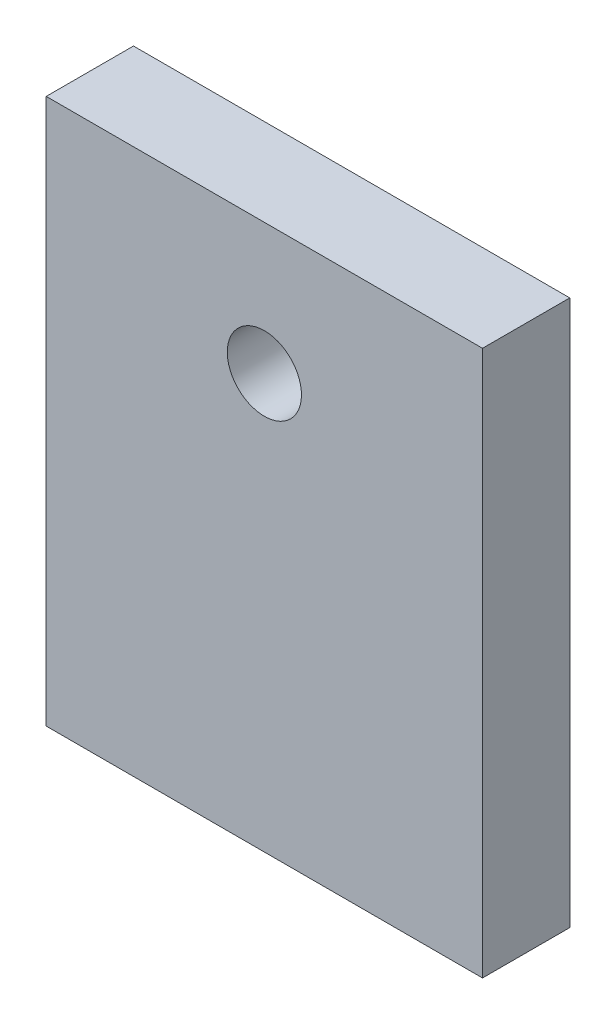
ISO-10303-21;
HEADER;
FILE_DESCRIPTION(('STEP AP214'),'2;1');
FILE_NAME('part.step','',(''),(''),'','','');
FILE_SCHEMA(('AUTOMOTIVE_DESIGN { 1 0 10303 214 1 1 1 1 }'));
ENDSEC;
DATA;
#1=APPLICATION_CONTEXT('core data for automotive mechanical design processes');
#2=APPLICATION_PROTOCOL_DEFINITION('international standard','automotive_design',2000,#1);
#3=PRODUCT_CONTEXT('',#1,'mechanical');
#4=PRODUCT('Part','Part','',(#3));
#5=PRODUCT_RELATED_PRODUCT_CATEGORY('part','',(#4));
#6=PRODUCT_DEFINITION_FORMATION('','',#4);
#7=PRODUCT_DEFINITION_CONTEXT('part definition',#1,'design');
#8=PRODUCT_DEFINITION('design','',#6,#7);
#9=PRODUCT_DEFINITION_SHAPE('','',#8);
#10=(LENGTH_UNIT() NAMED_UNIT(*) SI_UNIT(.MILLI.,.METRE.));
#11=(NAMED_UNIT(*) PLANE_ANGLE_UNIT() SI_UNIT($,.RADIAN.));
#12=(NAMED_UNIT(*) SI_UNIT($,.STERADIAN.) SOLID_ANGLE_UNIT());
#13=UNCERTAINTY_MEASURE_WITH_UNIT(LENGTH_MEASURE(1.E-05),#10,'distance_accuracy_value','');
#14=(GEOMETRIC_REPRESENTATION_CONTEXT(3) GLOBAL_UNCERTAINTY_ASSIGNED_CONTEXT((#13)) GLOBAL_UNIT_ASSIGNED_CONTEXT((#10,
#11,#12)) REPRESENTATION_CONTEXT('',''));
#15=CARTESIAN_POINT('',(0.,0.,0.));
#16=DIRECTION('',(0.,0.,1.));
#17=DIRECTION('',(1.,0.,0.));
#18=AXIS2_PLACEMENT_3D('',#15,#16,#17);
#19=CARTESIAN_POINT('',(0.,62.5,0.));
#20=DIRECTION('',(0.999999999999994,0.,0.));
#21=DIRECTION('',(0.,0.,-1.));
#22=AXIS2_PLACEMENT_3D('',#19,#20,#21);
#23=PLANE('',#22);
#24=DIRECTION('',(0.,0.,1.));
#25=VECTOR('',#24,1.);
#26=CARTESIAN_POINT('',(0.,0.,3.05311331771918E-13));
#27=LINE('',#26,#25);
#28=CARTESIAN_POINT('',(-1.22124532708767E-12,0.,-9.9999999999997));
#29=VERTEX_POINT('',#28);
#30=CARTESIAN_POINT('',(0.,0.,3.05311331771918E-13));
#31=VERTEX_POINT('',#30);
#32=EDGE_CURVE('E85',#29,#31,#27,.T.);
#33=ORIENTED_EDGE('',*,*,#32,.T.);
#34=DIRECTION('',(0.,-1.,0.));
#35=VECTOR('',#34,1.);
#36=CARTESIAN_POINT('',(0.,62.5,0.));
#37=LINE('',#36,#35);
#38=CARTESIAN_POINT('',(0.,62.5,0.));
#39=VERTEX_POINT('',#38);
#40=EDGE_CURVE('E11',#39,#31,#37,.T.);
#41=ORIENTED_EDGE('',*,*,#40,.F.);
#42=DIRECTION('',(0.,0.,1.));
#43=VECTOR('',#42,1.);
#44=CARTESIAN_POINT('',(0.,62.5,0.));
#45=LINE('',#44,#43);
#46=CARTESIAN_POINT('',(-1.22124532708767E-12,62.5,-9.99999999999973));
#47=VERTEX_POINT('',#46);
#48=EDGE_CURVE('E114',#47,#39,#45,.T.);
#49=ORIENTED_EDGE('',*,*,#48,.F.);
#50=DIRECTION('',(0.,-1.,0.));
#51=VECTOR('',#50,1.);
#52=CARTESIAN_POINT('',(-1.22124532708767E-12,62.5,-9.99999999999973));
#53=LINE('',#52,#51);
#54=EDGE_CURVE('E98',#47,#29,#53,.T.);
#55=ORIENTED_EDGE('',*,*,#54,.T.);
#56=EDGE_LOOP('',(#33,#41,#49,#55));
#57=FACE_BOUND('',#56,.T.);
#58=ADVANCED_FACE('F40',(#57),#23,.F.);
#59=CARTESIAN_POINT('',(0.,62.5,0.));
#60=DIRECTION('',(0.,0.,-1.));
#61=DIRECTION('',(-0.999999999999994,0.,0.));
#62=AXIS2_PLACEMENT_3D('',#59,#60,#61);
#63=PLANE('',#62);
#64=CARTESIAN_POINT('',(25.,47.5,0.));
#65=DIRECTION('',(0.,0.,-1.));
#66=DIRECTION('',(0.,1.,0.));
#67=AXIS2_PLACEMENT_3D('',#64,#65,#66);
#68=CIRCLE('',#67,4.25);
#69=CARTESIAN_POINT('',(25.,51.75,0.));
#70=VERTEX_POINT('',#69);
#71=EDGE_CURVE('E105',#70,#70,#68,.T.);
#72=ORIENTED_EDGE('',*,*,#71,.T.);
#73=EDGE_LOOP('',(#72));
#74=FACE_BOUND('',#73,.T.);
#75=DIRECTION('',(0.999999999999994,0.,0.));
#76=VECTOR('',#75,1.);
#77=CARTESIAN_POINT('',(0.,0.,3.05311331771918E-13));
#78=LINE('',#77,#76);
#79=CARTESIAN_POINT('',(50.,0.,0.));
#80=VERTEX_POINT('',#79);
#81=EDGE_CURVE('E81',#31,#80,#78,.T.);
#82=ORIENTED_EDGE('',*,*,#81,.T.);
#83=DIRECTION('',(0.,-1.,0.));
#84=VECTOR('',#83,1.);
#85=CARTESIAN_POINT('',(50.,62.5,0.));
#86=LINE('',#85,#84);
#87=CARTESIAN_POINT('',(50.,62.5,0.));
#88=VERTEX_POINT('',#87);
#89=EDGE_CURVE('E48',#88,#80,#86,.T.);
#90=ORIENTED_EDGE('',*,*,#89,.F.);
#91=DIRECTION('',(0.999999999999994,0.,0.));
#92=VECTOR('',#91,1.);
#93=CARTESIAN_POINT('',(0.,62.5,0.));
#94=LINE('',#93,#92);
#95=EDGE_CURVE('E94',#39,#88,#94,.T.);
#96=ORIENTED_EDGE('',*,*,#95,.F.);
#97=ORIENTED_EDGE('',*,*,#40,.T.);
#98=EDGE_LOOP('',(#82,#90,#96,#97));
#99=FACE_BOUND('',#98,.T.);
#100=ADVANCED_FACE('F93',(#74,#99),#63,.F.);
#101=CARTESIAN_POINT('',(50.,62.5,0.));
#102=DIRECTION('',(-0.999999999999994,0.,0.));
#103=DIRECTION('',(0.,0.,1.));
#104=AXIS2_PLACEMENT_3D('',#101,#102,#103);
#105=PLANE('',#104);
#106=DIRECTION('',(0.,0.,-1.));
#107=VECTOR('',#106,1.);
#108=CARTESIAN_POINT('',(50.,0.,0.));
#109=LINE('',#108,#107);
#110=CARTESIAN_POINT('',(49.9999999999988,0.,-9.99999999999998));
#111=VERTEX_POINT('',#110);
#112=EDGE_CURVE('E86',#80,#111,#109,.T.);
#113=ORIENTED_EDGE('',*,*,#112,.T.);
#114=DIRECTION('',(0.,-1.,0.));
#115=VECTOR('',#114,1.);
#116=CARTESIAN_POINT('',(49.9999999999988,62.5,-9.99999999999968));
#117=LINE('',#116,#115);
#118=CARTESIAN_POINT('',(49.9999999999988,62.5,-9.99999999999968));
#119=VERTEX_POINT('',#118);
#120=EDGE_CURVE('E125',#119,#111,#117,.T.);
#121=ORIENTED_EDGE('',*,*,#120,.F.);
#122=DIRECTION('',(0.,0.,-1.));
#123=VECTOR('',#122,1.);
#124=CARTESIAN_POINT('',(50.,62.5,0.));
#125=LINE('',#124,#123);
#126=EDGE_CURVE('E60',#88,#119,#125,.T.);
#127=ORIENTED_EDGE('',*,*,#126,.F.);
#128=ORIENTED_EDGE('',*,*,#89,.T.);
#129=EDGE_LOOP('',(#113,#121,#127,#128));
#130=FACE_BOUND('',#129,.T.);
#131=ADVANCED_FACE('F129',(#130),#105,.F.);
#132=CARTESIAN_POINT('',(-1.22124532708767E-12,62.5,-9.99999999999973));
#133=DIRECTION('',(0.,0.,1.));
#134=DIRECTION('',(0.999999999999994,0.,0.));
#135=AXIS2_PLACEMENT_3D('',#132,#133,#134);
#136=PLANE('',#135);
#137=CARTESIAN_POINT('',(24.9999999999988,47.5,-9.99999999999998));
#138=DIRECTION('',(0.,0.,-1.));
#139=DIRECTION('',(0.,1.,0.));
#140=AXIS2_PLACEMENT_3D('',#137,#138,#139);
#141=CIRCLE('',#140,4.25);
#142=CARTESIAN_POINT('',(24.9999999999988,51.75,-9.99999999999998));
#143=VERTEX_POINT('',#142);
#144=EDGE_CURVE('E100',#143,#143,#141,.T.);
#145=ORIENTED_EDGE('',*,*,#144,.F.);
#146=EDGE_LOOP('',(#145));
#147=FACE_BOUND('',#146,.T.);
#148=DIRECTION('',(-0.999999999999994,0.,0.));
#149=VECTOR('',#148,1.);
#150=CARTESIAN_POINT('',(-1.22124532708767E-12,0.,-9.9999999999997));
#151=LINE('',#150,#149);
#152=EDGE_CURVE('E111',#111,#29,#151,.T.);
#153=ORIENTED_EDGE('',*,*,#152,.T.);
#154=ORIENTED_EDGE('',*,*,#54,.F.);
#155=DIRECTION('',(-0.999999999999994,0.,0.));
#156=VECTOR('',#155,1.);
#157=CARTESIAN_POINT('',(-1.22124532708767E-12,62.5,-9.99999999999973));
#158=LINE('',#157,#156);
#159=EDGE_CURVE('E55',#119,#47,#158,.T.);
#160=ORIENTED_EDGE('',*,*,#159,.F.);
#161=ORIENTED_EDGE('',*,*,#120,.T.);
#162=EDGE_LOOP('',(#153,#154,#160,#161));
#163=FACE_BOUND('',#162,.T.);
#164=ADVANCED_FACE('F131',(#147,#163),#136,.F.);
#165=CARTESIAN_POINT('',(-1.22124532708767E-12,62.5,-9.99999999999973));
#166=DIRECTION('',(0.,-1.,0.));
#167=DIRECTION('',(0.,0.,-1.));
#168=AXIS2_PLACEMENT_3D('',#165,#166,#167);
#169=PLANE('',#168);
#170=ORIENTED_EDGE('',*,*,#48,.T.);
#171=ORIENTED_EDGE('',*,*,#95,.T.);
#172=ORIENTED_EDGE('',*,*,#126,.T.);
#173=ORIENTED_EDGE('',*,*,#159,.T.);
#174=EDGE_LOOP('',(#170,#171,#172,#173));
#175=FACE_BOUND('',#174,.T.);
#176=ADVANCED_FACE('F132',(#175),#169,.F.);
#177=CARTESIAN_POINT('',(-1.22124532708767E-12,0.,-9.9999999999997));
#178=DIRECTION('',(0.,-1.,0.));
#179=DIRECTION('',(0.,0.,-1.));
#180=AXIS2_PLACEMENT_3D('',#177,#178,#179);
#181=PLANE('',#180);
#182=ORIENTED_EDGE('',*,*,#32,.F.);
#183=ORIENTED_EDGE('',*,*,#152,.F.);
#184=ORIENTED_EDGE('',*,*,#112,.F.);
#185=ORIENTED_EDGE('',*,*,#81,.F.);
#186=EDGE_LOOP('',(#182,#183,#184,#185));
#187=FACE_BOUND('',#186,.T.);
#188=ADVANCED_FACE('F82',(#187),#181,.T.);
#189=CARTESIAN_POINT('',(24.9999999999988,47.5,-9.99999999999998));
#190=DIRECTION('',(0.,0.,-1.));
#191=DIRECTION('',(0.,1.,0.));
#192=AXIS2_PLACEMENT_3D('',#189,#190,#191);
#193=CYLINDRICAL_SURFACE('',#192,4.25);
#194=ORIENTED_EDGE('',*,*,#71,.F.);
#195=EDGE_LOOP('',(#194));
#196=FACE_BOUND('',#195,.T.);
#197=ORIENTED_EDGE('',*,*,#144,.T.);
#198=EDGE_LOOP('',(#197));
#199=FACE_BOUND('',#198,.T.);
#200=ADVANCED_FACE('F139',(#196,#199),#193,.F.);
#201=CLOSED_SHELL('',(#58,#100,#131,#164,#176,#188,#200));
#202=MANIFOLD_SOLID_BREP('B2',#201);
#203=ADVANCED_BREP_SHAPE_REPRESENTATION('',(#18,#202),#14);
#204=SHAPE_DEFINITION_REPRESENTATION(#9,#203);
ENDSEC;
END-ISO-10303-21;
